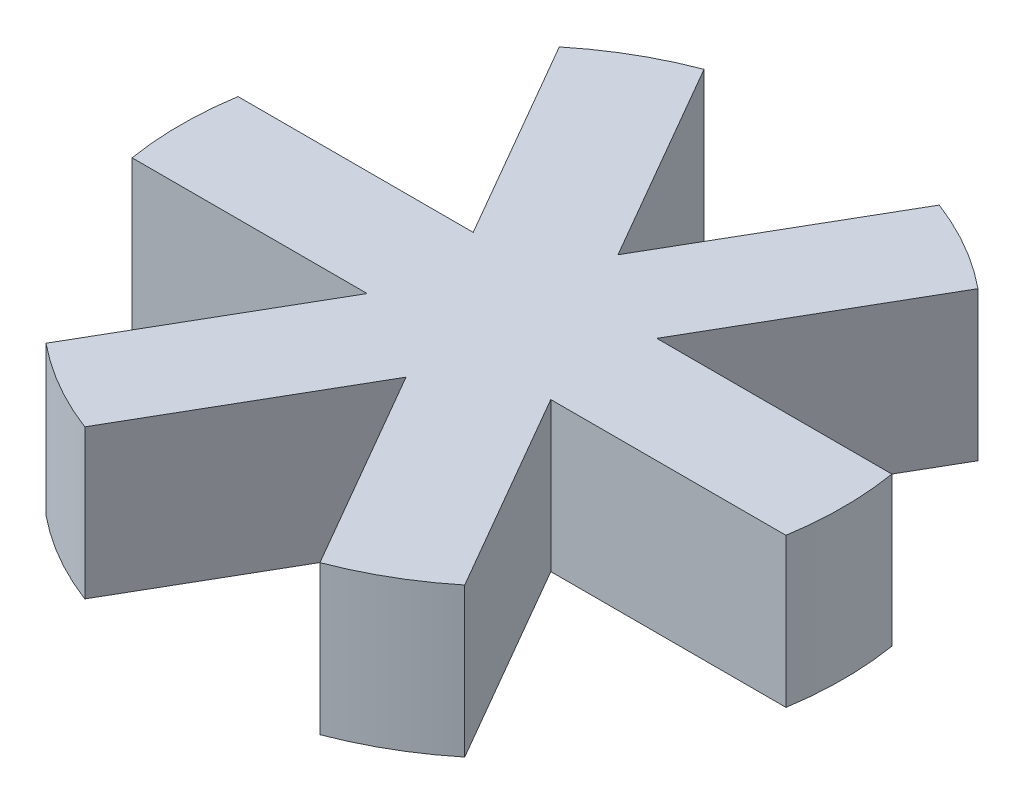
from build123d import *

# Parameters (mm, degrees)
BODY_DEPTH = 3.571875


with BuildPart() as part:
    # Sketch1 → body (new body)
    with BuildSketch(Plane(origin=(0, 0, 0), x_dir=(1, 0, 0), z_dir=(0, 1, 0))):
        with BuildLine():
            Line((2.199704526, 1.27), (7.835241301, 1.27))
            ThreePointArc((7.835241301, 1.27), (7.9375, 0), (7.835241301, -1.27))
            Line((7.835241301, -1.27), (2.199704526, -1.27))
            Line((2.199704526, -1.27), (5.017472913, -6.150518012))
            ThreePointArc((5.017472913, -6.150518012), (3.96875, -6.874076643), (2.817768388, -7.420518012))
            Line((2.817768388, -7.420518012), (0, -2.54))
            Line((0, -2.54), (-2.817768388, -7.420518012))
            ThreePointArc((-2.817768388, -7.420518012), (-3.96875, -6.874076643), (-5.017472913, -6.150518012))
            Line((-5.017472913, -6.150518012), (-2.199704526, -1.27))
            Line((-2.199704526, -1.27), (-7.835241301, -1.27))
            ThreePointArc((-7.835241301, -1.27), (-7.9375, 0), (-7.835241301, 1.27))
            Line((-7.835241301, 1.27), (-2.199704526, 1.27))
            Line((-2.199704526, 1.27), (-5.017472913, 6.150518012))
            ThreePointArc((-5.017472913, 6.150518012), (-3.96875, 6.874076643), (-2.817768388, 7.420518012))
            Line((-2.817768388, 7.420518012), (0, 2.54))
            Line((0, 2.54), (2.817768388, 7.420518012))
            ThreePointArc((2.817768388, 7.420518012), (3.96875, 6.874076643), (5.017472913, 6.150518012))
            Line((5.017472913, 6.150518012), (2.199704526, 1.27))
        make_face()
    extrude(amount=BODY_DEPTH)


solid = part.part
